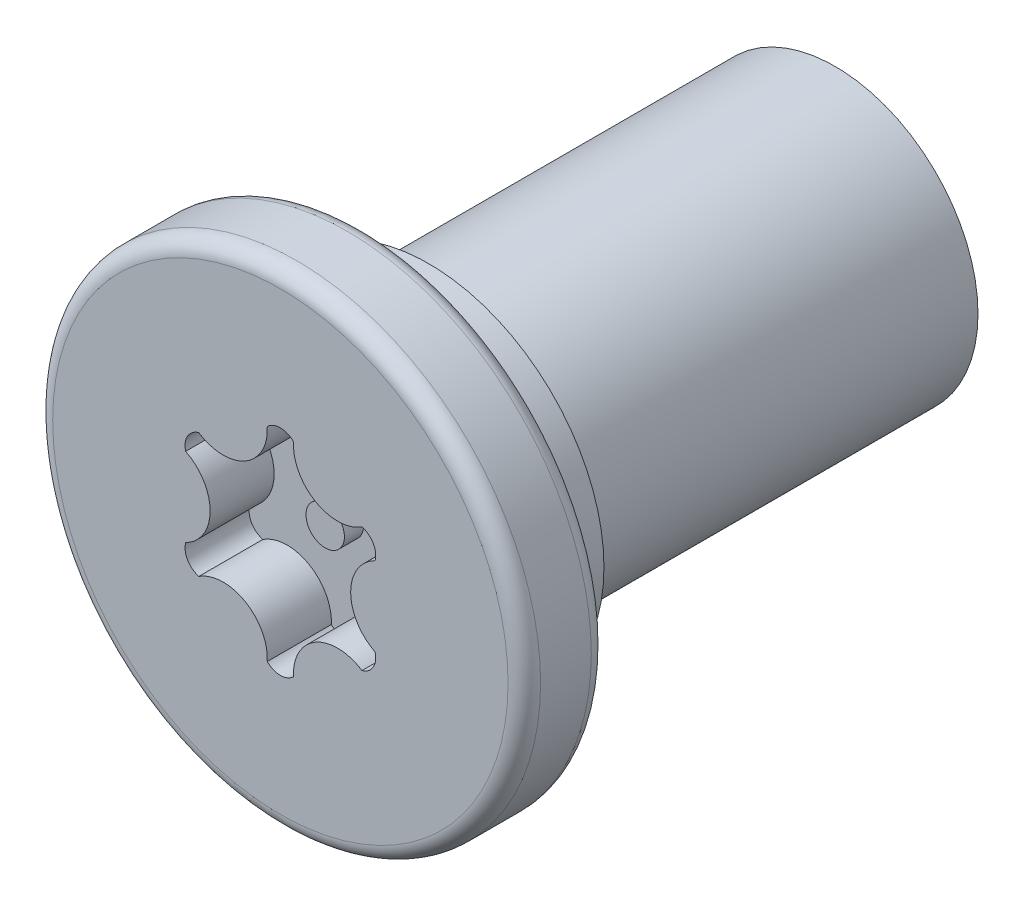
from build123d import *

# Parameters (mm, degrees)
SKETCH2_W           = 1.3
SKETCH2_H           = 3.81
SKETCH2_W_2         = 12.7
SKETCH2_H_2         = 2.23
CUT_EXTRUDE3_DEPTH  = 1
FILLET12_R          = 0.254
CUT_EXTRUDE6_START  = -12.7
SKETCH7_R           = 2.23
CUT_EXTRUDE6_DEPTH  = 12.7
SKETCH11_R          = 2.738000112
SKETCH11_R_2        = 2.230000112
BOSS_EXTRUDE1_DEPTH = 1.016
SKETCH12_R          = 2.230000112
BOSS_EXTRUDE2_DEPTH = 12.7
SKETCH14_R          = 0.3
BOSS_EXTRUDE4_DEPTH = 0.3
CUT_EXTRUDE7_START  = -12.7
SKETCH15_R          = 2.230000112
CUT_EXTRUDE7_DEPTH  = 12.7
SKETCH16_R          = 2.230000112
BOSS_EXTRUDE5_DEPTH = 7.366


with BuildPart() as part:
    # Sketch2 → Revolve1 (revolve)
    with BuildSketch(Plane(origin=(0, 0, 0), x_dir=(0, 0, -1), z_dir=(1, 0, 0)), mode=Mode.PRIVATE) as revolve1_sk:
        with Locations((0.65, 1.905)):
            Rectangle(SKETCH2_W, SKETCH2_H)
        with Locations((7.65, 1.115)):
            Rectangle(SKETCH2_W_2, SKETCH2_H_2)
    revolve(revolve1_sk.sketch.rotate(Axis((0, 0, -1.3), (0, 0, -1)), 90), axis=Axis((0, 0, -1.3), (0, 0, -1)))

    # Sketch3 → Cut-Extrude3 (cut)
    with BuildSketch(Plane.XY):
        with BuildLine():
            ThreePointArc((-0.205060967, 1.589373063), (0, 1.674312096), (0.205060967, 1.589373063))
            ThreePointArc((0.205060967, 1.589373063), (0.54882888, 0.950599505), (1.273906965, 0.972274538))
            ThreePointArc((1.273906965, 0.972274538), (1.449996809, 0.837156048), (1.478967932, 0.617098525))
            ThreePointArc((1.478967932, 0.617098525), (1.097657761, 0), (1.478967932, -0.617098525))
            ThreePointArc((1.478967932, -0.617098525), (1.449996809, -0.837156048), (1.273906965, -0.972274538))
            ThreePointArc((1.273906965, -0.972274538), (0.54882888, -0.950599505), (0.205060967, -1.589373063))
            ThreePointArc((0.205060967, -1.589373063), (0, -1.674312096), (-0.205060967, -1.589373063))
            ThreePointArc((-0.205060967, -1.589373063), (-0.54882888, -0.950599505), (-1.273906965, -0.972274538))
            ThreePointArc((-1.273906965, -0.972274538), (-1.449996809, -0.837156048), (-1.478967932, -0.617098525))
            ThreePointArc((-1.478967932, -0.617098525), (-1.097657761, 0), (-1.478967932, 0.617098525))
            ThreePointArc((-1.478967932, 0.617098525), (-1.449996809, 0.837156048), (-1.273906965, 0.972274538))
            ThreePointArc((-1.273906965, 0.972274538), (-0.54882888, 0.950599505), (-0.205060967, 1.589373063))
        make_face()
    extrude(amount=-CUT_EXTRUDE3_DEPTH, mode=Mode.SUBTRACT)

    # Fillet12
    fillet12_edges = [part.edges().sort_by_distance(p)[0] for p in [
        (-3.81, 0, 0),
        (-3.81, 0, -1.3),
    ]]
    fillet(fillet12_edges, radius=FILLET12_R)

    # Sketch7 → Cut-Extrude6 (cut)
    with BuildSketch(Plane(origin=(0, 0, -14), x_dir=(-1, 0, 0), z_dir=(0, 0, -1)).offset(CUT_EXTRUDE6_START)):
        Circle(SKETCH7_R)
    extrude(amount=CUT_EXTRUDE6_DEPTH, mode=Mode.SUBTRACT)

    # Sketch11 → Boss-Extrude1 (add)
    with BuildSketch(Plane(origin=(0, 0, -1.3), x_dir=(-1, 0, 0), z_dir=(0, 0, -1))):
        with Locations(Location((0, 0, 0), (0, 0, 180))):
            Circle(SKETCH11_R)
        Circle(SKETCH11_R_2, mode=Mode.SUBTRACT)
    extrude(amount=BOSS_EXTRUDE1_DEPTH)

    # Sketch12 → Boss-Extrude2 (add)
    with BuildSketch(Plane(origin=(0, 0, -1.3), x_dir=(-1, 0, 0), z_dir=(0, 0, -1))):
        Circle(SKETCH12_R)
    extrude(amount=BOSS_EXTRUDE2_DEPTH)

    # Sketch14 → Boss-Extrude4 (add)
    with BuildSketch(Plane.XY.offset(-1)):
        Circle(SKETCH14_R)
    extrude(amount=BOSS_EXTRUDE4_DEPTH)

    # Sketch15 → Cut-Extrude7 (cut)
    with BuildSketch(Plane(origin=(0, 0, -14), x_dir=(-1, 0, 0), z_dir=(0, 0, -1)).offset(CUT_EXTRUDE7_START)):
        Circle(SKETCH15_R)
    extrude(amount=CUT_EXTRUDE7_DEPTH, mode=Mode.SUBTRACT)

    # Sketch16 → Boss-Extrude5 (add)
    with BuildSketch(Plane(origin=(0, 0, -1.3), x_dir=(-1, 0, 0), z_dir=(0, 0, -1))):
        Circle(SKETCH16_R)
    extrude(amount=BOSS_EXTRUDE5_DEPTH)


solid = part.part
